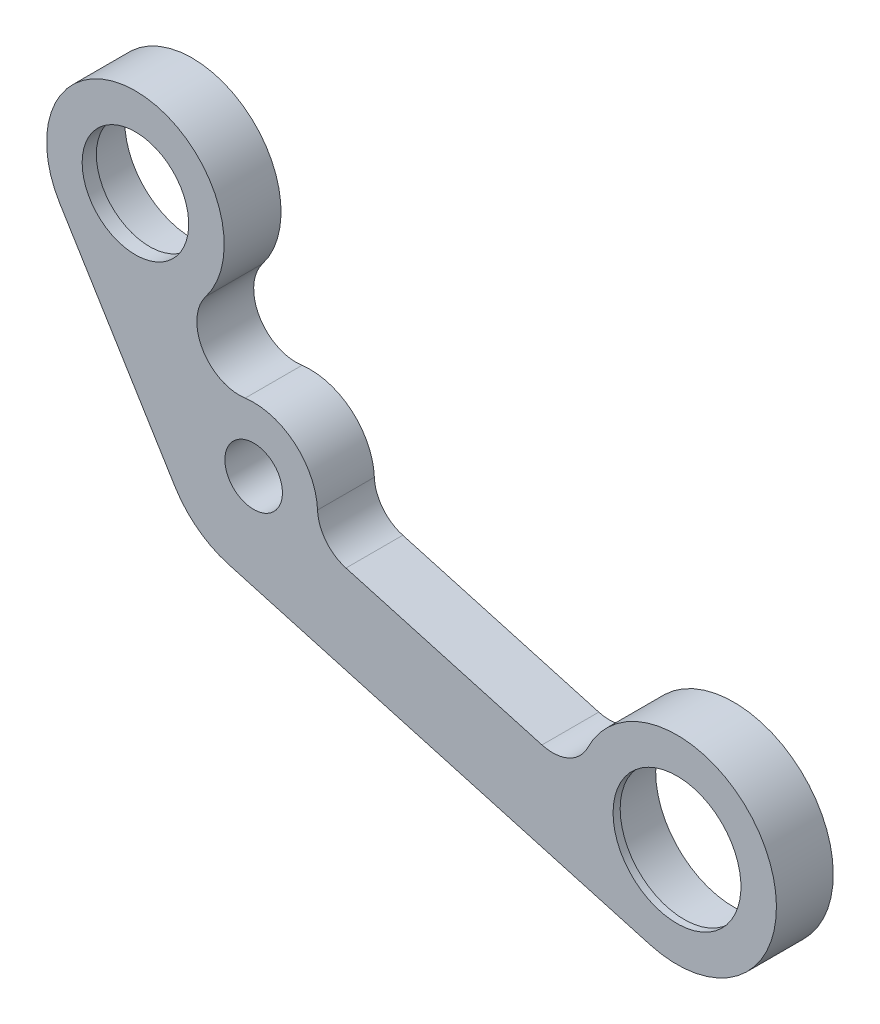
ISO-10303-21;
HEADER;
FILE_DESCRIPTION(('STEP AP214'),'2;1');
FILE_NAME('part.step','',(''),(''),'','','');
FILE_SCHEMA(('AUTOMOTIVE_DESIGN { 1 0 10303 214 1 1 1 1 }'));
ENDSEC;
DATA;
#1=APPLICATION_CONTEXT('core data for automotive mechanical design processes');
#2=APPLICATION_PROTOCOL_DEFINITION('international standard','automotive_design',2000,#1);
#3=PRODUCT_CONTEXT('',#1,'mechanical');
#4=PRODUCT('Part','Part','',(#3));
#5=PRODUCT_RELATED_PRODUCT_CATEGORY('part','',(#4));
#6=PRODUCT_DEFINITION_FORMATION('','',#4);
#7=PRODUCT_DEFINITION_CONTEXT('part definition',#1,'design');
#8=PRODUCT_DEFINITION('design','',#6,#7);
#9=PRODUCT_DEFINITION_SHAPE('','',#8);
#10=(LENGTH_UNIT() NAMED_UNIT(*) SI_UNIT(.MILLI.,.METRE.));
#11=(NAMED_UNIT(*) PLANE_ANGLE_UNIT() SI_UNIT($,.RADIAN.));
#12=(NAMED_UNIT(*) SI_UNIT($,.STERADIAN.) SOLID_ANGLE_UNIT());
#13=UNCERTAINTY_MEASURE_WITH_UNIT(LENGTH_MEASURE(1.E-05),#10,'distance_accuracy_value','');
#14=(GEOMETRIC_REPRESENTATION_CONTEXT(3) GLOBAL_UNCERTAINTY_ASSIGNED_CONTEXT((#13)) GLOBAL_UNIT_ASSIGNED_CONTEXT((#10,
#11,#12)) REPRESENTATION_CONTEXT('',''));
#15=CARTESIAN_POINT('',(0.,0.,0.));
#16=DIRECTION('',(0.,0.,1.));
#17=DIRECTION('',(1.,0.,0.));
#18=AXIS2_PLACEMENT_3D('',#15,#16,#17);
#19=CARTESIAN_POINT('',(-59.10260396,256.225433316,25.));
#20=DIRECTION('',(0.,0.,-1.));
#21=DIRECTION('',(-1.,0.,0.));
#22=AXIS2_PLACEMENT_3D('',#19,#20,#21);
#23=CYLINDRICAL_SURFACE('',#22,7.499999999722);
#24=CARTESIAN_POINT('',(-59.10260396,256.225433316,23.));
#25=DIRECTION('',(0.,0.,-1.));
#26=DIRECTION('',(-1.,0.,0.));
#27=AXIS2_PLACEMENT_3D('',#24,#25,#26);
#28=CIRCLE('',#27,7.499999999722);
#29=CARTESIAN_POINT('',(-66.602603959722,256.225433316,23.));
#30=VERTEX_POINT('',#29);
#31=EDGE_CURVE('E217',#30,#30,#28,.F.);
#32=ORIENTED_EDGE('',*,*,#31,.F.);
#33=EDGE_LOOP('',(#32));
#34=FACE_BOUND('',#33,.T.);
#35=CARTESIAN_POINT('',(-59.10260396,256.225433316,25.));
#36=DIRECTION('',(0.,0.,-1.));
#37=DIRECTION('',(-1.,0.,0.));
#38=AXIS2_PLACEMENT_3D('',#35,#36,#37);
#39=CIRCLE('',#38,7.499999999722);
#40=CARTESIAN_POINT('',(-66.602603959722,256.225433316,25.));
#41=VERTEX_POINT('',#40);
#42=EDGE_CURVE('E21',#41,#41,#39,.T.);
#43=ORIENTED_EDGE('',*,*,#42,.F.);
#44=EDGE_LOOP('',(#43));
#45=FACE_BOUND('',#44,.T.);
#46=ADVANCED_FACE('F17',(#34,#45),#23,.F.);
#47=CARTESIAN_POINT('',(16.439924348,182.567015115,25.));
#48=DIRECTION('',(0.,0.,1.));
#49=DIRECTION('',(0.481671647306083,0.876351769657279,0.));
#50=AXIS2_PLACEMENT_3D('',#47,#48,#49);
#51=PLANE('',#50);
#52=ORIENTED_EDGE('',*,*,#42,.T.);
#53=EDGE_LOOP('',(#52));
#54=FACE_BOUND('',#53,.T.);
#55=CARTESIAN_POINT('',(-42.457488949,230.060145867,25.));
#56=DIRECTION('',(0.,0.,-1.));
#57=DIRECTION('',(-1.,0.,0.));
#58=AXIS2_PLACEMENT_3D('',#55,#56,#57);
#59=CIRCLE('',#58,4.0500000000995);
#60=CARTESIAN_POINT('',(-46.5074889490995,230.060145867,25.));
#61=VERTEX_POINT('',#60);
#62=EDGE_CURVE('E102',#61,#61,#59,.F.);
#63=ORIENTED_EDGE('',*,*,#62,.F.);
#64=EDGE_LOOP('',(#63));
#65=FACE_BOUND('',#64,.T.);
#66=CARTESIAN_POINT('',(17.14,214.32,25.));
#67=DIRECTION('',(0.,0.,-1.));
#68=DIRECTION('',(-1.,0.,0.));
#69=AXIS2_PLACEMENT_3D('',#66,#67,#68);
#70=CIRCLE('',#69,9.00000000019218);
#71=CARTESIAN_POINT('',(8.13999999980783,214.32,25.));
#72=VERTEX_POINT('',#71);
#73=EDGE_CURVE('E113',#72,#72,#70,.F.);
#74=ORIENTED_EDGE('',*,*,#73,.F.);
#75=EDGE_LOOP('',(#74));
#76=FACE_BOUND('',#75,.T.);
#77=CARTESIAN_POINT('',(-42.457488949,230.060145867,25.));
#78=DIRECTION('',(0.,0.,1.));
#79=DIRECTION('',(1.,0.,0.));
#80=AXIS2_PLACEMENT_3D('',#77,#78,#79);
#81=CIRCLE('',#80,13.0000000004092);
#82=CARTESIAN_POINT('',(-53.5372151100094,223.260170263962,25.));
#83=VERTEX_POINT('',#82);
#84=CARTESIAN_POINT('',(-45.9805335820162,217.546626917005,25.));
#85=VERTEX_POINT('',#84);
#86=EDGE_CURVE('E196',#83,#85,#81,.T.);
#87=ORIENTED_EDGE('',*,*,#86,.T.);
#88=DIRECTION('',(0.962578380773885,-0.271003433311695,0.));
#89=VECTOR('',#88,1.);
#90=CARTESIAN_POINT('',(-16.317290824,209.195264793,25.));
#91=LINE('',#90,#89);
#92=CARTESIAN_POINT('',(13.3459519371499,200.843902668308,25.));
#93=VERTEX_POINT('',#92);
#94=EDGE_CURVE('E99',#85,#93,#91,.T.);
#95=ORIENTED_EDGE('',*,*,#94,.T.);
#96=CARTESIAN_POINT('',(17.14,214.32,25.));
#97=DIRECTION('',(0.,0.,1.));
#98=DIRECTION('',(1.,0.,0.));
#99=AXIS2_PLACEMENT_3D('',#96,#97,#98);
#100=CIRCLE('',#99,13.9999999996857);
#101=CARTESIAN_POINT('',(4.56373326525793,220.471220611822,25.));
#102=VERTEX_POINT('',#101);
#103=EDGE_CURVE('E96',#93,#102,#100,.T.);
#104=ORIENTED_EDGE('',*,*,#103,.T.);
#105=CARTESIAN_POINT('',(-0.376942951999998,222.887771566,25.));
#106=DIRECTION('',(0.,0.,1.));
#107=DIRECTION('',(1.,0.,0.));
#108=AXIS2_PLACEMENT_3D('',#105,#106,#107);
#109=CIRCLE('',#108,5.49999999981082);
#110=CARTESIAN_POINT('',(-1.86746183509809,217.593590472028,25.));
#111=VERTEX_POINT('',#110);
#112=EDGE_CURVE('E94',#111,#102,#109,.T.);
#113=ORIENTED_EDGE('',*,*,#112,.F.);
#114=DIRECTION('',(-0.962578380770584,0.271003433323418,0.));
#115=VECTOR('',#114,1.);
#116=CARTESIAN_POINT('',(-15.6638634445,221.477816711,25.));
#117=LINE('',#116,#115);
#118=CARTESIAN_POINT('',(-29.4602650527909,225.3620429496,25.));
#119=VERTEX_POINT('',#118);
#120=EDGE_CURVE('E123',#111,#119,#117,.T.);
#121=ORIENTED_EDGE('',*,*,#120,.T.);
#122=CARTESIAN_POINT('',(-27.969746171,230.656224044,25.));
#123=DIRECTION('',(0.,0.,1.));
#124=DIRECTION('',(1.,0.,0.));
#125=AXIS2_PLACEMENT_3D('',#122,#123,#124);
#126=CIRCLE('',#125,5.49999999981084);
#127=CARTESIAN_POINT('',(-33.4650968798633,230.430125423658,25.));
#128=VERTEX_POINT('',#127);
#129=EDGE_CURVE('E136',#128,#119,#126,.T.);
#130=ORIENTED_EDGE('',*,*,#129,.F.);
#131=CARTESIAN_POINT('',(-42.457488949,230.060145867,25.));
#132=DIRECTION('',(0.,0.,1.));
#133=DIRECTION('',(1.,0.,0.));
#134=AXIS2_PLACEMENT_3D('',#131,#132,#133);
#135=CIRCLE('',#134,8.99999999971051);
#136=CARTESIAN_POINT('',(-43.6552435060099,238.980088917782,25.));
#137=VERTEX_POINT('',#136);
#138=EDGE_CURVE('E207',#128,#137,#135,.T.);
#139=ORIENTED_EDGE('',*,*,#138,.T.);
#140=CARTESIAN_POINT('',(-44.453746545,244.926717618,25.));
#141=DIRECTION('',(0.,0.,1.));
#142=DIRECTION('',(1.,0.,0.));
#143=AXIS2_PLACEMENT_3D('',#140,#141,#142);
#144=CIRCLE('',#143,6.00000000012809);
#145=CARTESIAN_POINT('',(-49.2047273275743,248.5911659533,25.));
#146=VERTEX_POINT('',#145);
#147=EDGE_CURVE('E203',#146,#137,#144,.T.);
#148=ORIENTED_EDGE('',*,*,#147,.F.);
#149=CARTESIAN_POINT('',(-59.10260396,256.225433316,25.));
#150=DIRECTION('',(0.,0.,1.));
#151=DIRECTION('',(1.,0.,0.));
#152=AXIS2_PLACEMENT_3D('',#149,#150,#151);
#153=CIRCLE('',#152,12.5000000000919);
#154=CARTESIAN_POINT('',(-69.7561868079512,249.68699523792,25.));
#155=VERTEX_POINT('',#154);
#156=EDGE_CURVE('E199',#146,#155,#153,.T.);
#157=ORIENTED_EDGE('',*,*,#156,.T.);
#158=DIRECTION('',(0.52307504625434,-0.852286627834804,0.));
#159=VECTOR('',#158,1.);
#160=CARTESIAN_POINT('',(-61.6467009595,236.473582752,25.));
#161=LINE('',#160,#159);
#162=EDGE_CURVE('E130',#155,#83,#161,.T.);
#163=ORIENTED_EDGE('',*,*,#162,.T.);
#164=EDGE_LOOP('',(#87,#95,#104,#113,#121,#130,#139,#148,#157,#163));
#165=FACE_BOUND('',#164,.T.);
#166=ADVANCED_FACE('F97',(#54,#65,#76,#165),#51,.T.);
#167=CARTESIAN_POINT('',(-46.046566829,260.019888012,23.));
#168=DIRECTION('',(0.,0.,-1.));
#169=DIRECTION('',(-0.481671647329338,-0.876351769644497,0.));
#170=AXIS2_PLACEMENT_3D('',#167,#168,#169);
#171=PLANE('',#170);
#172=ORIENTED_EDGE('',*,*,#31,.T.);
#173=EDGE_LOOP('',(#172));
#174=FACE_BOUND('',#173,.T.);
#175=CARTESIAN_POINT('',(-59.10260396,256.225433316,23.));
#176=DIRECTION('',(0.,0.,-1.));
#177=DIRECTION('',(-1.,0.,0.));
#178=AXIS2_PLACEMENT_3D('',#175,#176,#177);
#179=CIRCLE('',#178,9.5000000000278);
#180=CARTESIAN_POINT('',(-68.6026039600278,256.225433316,23.));
#181=VERTEX_POINT('',#180);
#182=EDGE_CURVE('E189',#181,#181,#179,.F.);
#183=ORIENTED_EDGE('',*,*,#182,.F.);
#184=EDGE_LOOP('',(#183));
#185=FACE_BOUND('',#184,.T.);
#186=ADVANCED_FACE('F237',(#174,#185),#171,.T.);
#187=CARTESIAN_POINT('',(17.14,214.32,25.));
#188=DIRECTION('',(0.,0.,-1.));
#189=DIRECTION('',(-1.,0.,0.));
#190=AXIS2_PLACEMENT_3D('',#187,#188,#189);
#191=CYLINDRICAL_SURFACE('',#190,9.00000000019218);
#192=ORIENTED_EDGE('',*,*,#73,.T.);
#193=EDGE_LOOP('',(#192));
#194=FACE_BOUND('',#193,.T.);
#195=CARTESIAN_POINT('',(17.14,214.32,24.));
#196=DIRECTION('',(0.,0.,-1.));
#197=DIRECTION('',(-1.,0.,0.));
#198=AXIS2_PLACEMENT_3D('',#195,#196,#197);
#199=CIRCLE('',#198,9.00000000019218);
#200=CARTESIAN_POINT('',(8.13999999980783,214.32,24.));
#201=VERTEX_POINT('',#200);
#202=EDGE_CURVE('E185',#201,#201,#199,.F.);
#203=ORIENTED_EDGE('',*,*,#202,.F.);
#204=EDGE_LOOP('',(#203));
#205=FACE_BOUND('',#204,.T.);
#206=ADVANCED_FACE('F256',(#194,#205),#191,.F.);
#207=CARTESIAN_POINT('',(-0.376942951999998,222.887771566,17.));
#208=DIRECTION('',(0.,0.,1.));
#209=DIRECTION('',(1.,0.,0.));
#210=AXIS2_PLACEMENT_3D('',#207,#208,#209);
#211=CYLINDRICAL_SURFACE('',#210,5.49999999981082);
#212=CARTESIAN_POINT('',(-0.376942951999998,222.887771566,17.));
#213=DIRECTION('',(0.,0.,1.));
#214=DIRECTION('',(1.,0.,0.));
#215=AXIS2_PLACEMENT_3D('',#212,#213,#214);
#216=CIRCLE('',#215,5.49999999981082);
#217=CARTESIAN_POINT('',(4.56373326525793,220.471220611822,17.));
#218=VERTEX_POINT('',#217);
#219=CARTESIAN_POINT('',(-1.86746183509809,217.593590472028,17.));
#220=VERTEX_POINT('',#219);
#221=EDGE_CURVE('E182',#218,#220,#216,.F.);
#222=ORIENTED_EDGE('',*,*,#221,.T.);
#223=DIRECTION('',(0.,0.,1.));
#224=VECTOR('',#223,1.);
#225=CARTESIAN_POINT('',(-1.86746183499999,217.593590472,21.));
#226=LINE('',#225,#224);
#227=EDGE_CURVE('E111',#220,#111,#226,.T.);
#228=ORIENTED_EDGE('',*,*,#227,.T.);
#229=ORIENTED_EDGE('',*,*,#112,.T.);
#230=DIRECTION('',(0.,0.,1.));
#231=VECTOR('',#230,1.);
#232=CARTESIAN_POINT('',(4.56373326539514,220.471220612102,21.));
#233=LINE('',#232,#231);
#234=EDGE_CURVE('E109',#102,#218,#233,.F.);
#235=ORIENTED_EDGE('',*,*,#234,.T.);
#236=EDGE_LOOP('',(#222,#228,#229,#235));
#237=FACE_BOUND('',#236,.T.);
#238=ADVANCED_FACE('F108',(#237),#211,.F.);
#239=CARTESIAN_POINT('',(-1.86746183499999,217.593590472,25.));
#240=DIRECTION('',(-0.271003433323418,-0.962578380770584,0.));
#241=DIRECTION('',(-0.962578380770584,0.271003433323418,0.));
#242=AXIS2_PLACEMENT_3D('',#239,#240,#241);
#243=PLANE('',#242);
#244=ORIENTED_EDGE('',*,*,#227,.F.);
#245=DIRECTION('',(-0.962578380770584,0.271003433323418,0.));
#246=VECTOR('',#245,1.);
#247=CARTESIAN_POINT('',(-1.86746183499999,217.593590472,17.));
#248=LINE('',#247,#246);
#249=CARTESIAN_POINT('',(-29.4602650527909,225.3620429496,17.));
#250=VERTEX_POINT('',#249);
#251=EDGE_CURVE('E178',#220,#250,#248,.T.);
#252=ORIENTED_EDGE('',*,*,#251,.T.);
#253=DIRECTION('',(0.,0.,1.));
#254=VECTOR('',#253,1.);
#255=CARTESIAN_POINT('',(-29.4602650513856,225.362042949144,21.));
#256=LINE('',#255,#254);
#257=EDGE_CURVE('E213',#119,#250,#256,.F.);
#258=ORIENTED_EDGE('',*,*,#257,.F.);
#259=ORIENTED_EDGE('',*,*,#120,.F.);
#260=EDGE_LOOP('',(#244,#252,#258,#259));
#261=FACE_BOUND('',#260,.T.);
#262=ADVANCED_FACE('F257',(#261),#243,.F.);
#263=CARTESIAN_POINT('',(-27.969746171,230.656224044,17.));
#264=DIRECTION('',(0.,0.,1.));
#265=DIRECTION('',(1.,0.,0.));
#266=AXIS2_PLACEMENT_3D('',#263,#264,#265);
#267=CYLINDRICAL_SURFACE('',#266,5.49999999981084);
#268=CARTESIAN_POINT('',(-27.969746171,230.656224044,17.));
#269=DIRECTION('',(0.,0.,1.));
#270=DIRECTION('',(1.,0.,0.));
#271=AXIS2_PLACEMENT_3D('',#268,#269,#270);
#272=CIRCLE('',#271,5.49999999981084);
#273=CARTESIAN_POINT('',(-33.4650968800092,230.430125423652,17.));
#274=VERTEX_POINT('',#273);
#275=EDGE_CURVE('E174',#250,#274,#272,.F.);
#276=ORIENTED_EDGE('',*,*,#275,.T.);
#277=DIRECTION('',(0.,0.,-1.));
#278=VECTOR('',#277,1.);
#279=CARTESIAN_POINT('',(-33.4650968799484,230.430125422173,21.));
#280=LINE('',#279,#278);
#281=EDGE_CURVE('E211',#274,#128,#280,.F.);
#282=ORIENTED_EDGE('',*,*,#281,.T.);
#283=ORIENTED_EDGE('',*,*,#129,.T.);
#284=ORIENTED_EDGE('',*,*,#257,.T.);
#285=EDGE_LOOP('',(#276,#282,#283,#284));
#286=FACE_BOUND('',#285,.T.);
#287=ADVANCED_FACE('F260',(#286),#267,.F.);
#288=CARTESIAN_POINT('',(-42.457488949,230.060145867,17.));
#289=DIRECTION('',(0.,0.,1.));
#290=DIRECTION('',(1.,0.,0.));
#291=AXIS2_PLACEMENT_3D('',#288,#289,#290);
#292=CYLINDRICAL_SURFACE('',#291,8.99999999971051);
#293=CARTESIAN_POINT('',(-42.457488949,230.060145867,17.));
#294=DIRECTION('',(0.,0.,1.));
#295=DIRECTION('',(1.,0.,0.));
#296=AXIS2_PLACEMENT_3D('',#293,#294,#295);
#297=CIRCLE('',#296,8.99999999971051);
#298=CARTESIAN_POINT('',(-43.6552435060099,238.980088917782,17.));
#299=VERTEX_POINT('',#298);
#300=EDGE_CURVE('E170',#274,#299,#297,.T.);
#301=ORIENTED_EDGE('',*,*,#300,.T.);
#302=DIRECTION('',(0.,0.,1.));
#303=VECTOR('',#302,1.);
#304=CARTESIAN_POINT('',(-43.6552435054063,238.980088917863,21.));
#305=LINE('',#304,#303);
#306=EDGE_CURVE('E206',#137,#299,#305,.F.);
#307=ORIENTED_EDGE('',*,*,#306,.F.);
#308=ORIENTED_EDGE('',*,*,#138,.F.);
#309=ORIENTED_EDGE('',*,*,#281,.F.);
#310=EDGE_LOOP('',(#301,#307,#308,#309));
#311=FACE_BOUND('',#310,.T.);
#312=ADVANCED_FACE('F291',(#311),#292,.T.);
#313=CARTESIAN_POINT('',(-44.453746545,244.926717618,17.));
#314=DIRECTION('',(0.,0.,1.));
#315=DIRECTION('',(1.,0.,0.));
#316=AXIS2_PLACEMENT_3D('',#313,#314,#315);
#317=CYLINDRICAL_SURFACE('',#316,6.00000000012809);
#318=CARTESIAN_POINT('',(-44.453746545,244.926717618,17.));
#319=DIRECTION('',(0.,0.,1.));
#320=DIRECTION('',(1.,0.,0.));
#321=AXIS2_PLACEMENT_3D('',#318,#319,#320);
#322=CIRCLE('',#321,6.00000000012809);
#323=CARTESIAN_POINT('',(-49.204727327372,248.591165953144,17.));
#324=VERTEX_POINT('',#323);
#325=EDGE_CURVE('E166',#299,#324,#322,.F.);
#326=ORIENTED_EDGE('',*,*,#325,.T.);
#327=DIRECTION('',(0.,0.,-1.));
#328=VECTOR('',#327,1.);
#329=CARTESIAN_POINT('',(-49.2047273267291,248.591165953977,21.));
#330=LINE('',#329,#328);
#331=EDGE_CURVE('E202',#324,#146,#330,.F.);
#332=ORIENTED_EDGE('',*,*,#331,.T.);
#333=ORIENTED_EDGE('',*,*,#147,.T.);
#334=ORIENTED_EDGE('',*,*,#306,.T.);
#335=EDGE_LOOP('',(#326,#332,#333,#334));
#336=FACE_BOUND('',#335,.T.);
#337=ADVANCED_FACE('F295',(#336),#317,.F.);
#338=CARTESIAN_POINT('',(-59.10260396,256.225433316,17.));
#339=DIRECTION('',(0.,0.,1.));
#340=DIRECTION('',(1.,0.,0.));
#341=AXIS2_PLACEMENT_3D('',#338,#339,#340);
#342=CYLINDRICAL_SURFACE('',#341,12.5000000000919);
#343=CARTESIAN_POINT('',(-59.10260396,256.225433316,17.));
#344=DIRECTION('',(0.,0.,1.));
#345=DIRECTION('',(1.,0.,0.));
#346=AXIS2_PLACEMENT_3D('',#343,#344,#345);
#347=CIRCLE('',#346,12.5000000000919);
#348=CARTESIAN_POINT('',(-69.7561868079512,249.68699523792,17.));
#349=VERTEX_POINT('',#348);
#350=EDGE_CURVE('E162',#324,#349,#347,.T.);
#351=ORIENTED_EDGE('',*,*,#350,.T.);
#352=DIRECTION('',(0.,0.,1.));
#353=VECTOR('',#352,1.);
#354=CARTESIAN_POINT('',(-69.756186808,249.686995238,21.));
#355=LINE('',#354,#353);
#356=EDGE_CURVE('E134',#349,#155,#355,.T.);
#357=ORIENTED_EDGE('',*,*,#356,.T.);
#358=ORIENTED_EDGE('',*,*,#156,.F.);
#359=ORIENTED_EDGE('',*,*,#331,.F.);
#360=EDGE_LOOP('',(#351,#357,#358,#359));
#361=FACE_BOUND('',#360,.T.);
#362=ADVANCED_FACE('F266',(#361),#342,.T.);
#363=CARTESIAN_POINT('',(-69.756186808,249.686995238,25.));
#364=DIRECTION('',(0.852286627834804,0.52307504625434,0.));
#365=DIRECTION('',(0.52307504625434,-0.852286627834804,0.));
#366=AXIS2_PLACEMENT_3D('',#363,#364,#365);
#367=PLANE('',#366);
#368=ORIENTED_EDGE('',*,*,#356,.F.);
#369=DIRECTION('',(0.52307504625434,-0.852286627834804,0.));
#370=VECTOR('',#369,1.);
#371=CARTESIAN_POINT('',(-69.756186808,249.686995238,17.));
#372=LINE('',#371,#370);
#373=CARTESIAN_POINT('',(-53.5372151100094,223.260170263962,17.));
#374=VERTEX_POINT('',#373);
#375=EDGE_CURVE('E158',#349,#374,#372,.T.);
#376=ORIENTED_EDGE('',*,*,#375,.T.);
#377=DIRECTION('',(0.,0.,-1.));
#378=VECTOR('',#377,1.);
#379=CARTESIAN_POINT('',(-53.5372151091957,223.260170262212,21.));
#380=LINE('',#379,#378);
#381=EDGE_CURVE('E133',#374,#83,#380,.F.);
#382=ORIENTED_EDGE('',*,*,#381,.T.);
#383=ORIENTED_EDGE('',*,*,#162,.F.);
#384=EDGE_LOOP('',(#368,#376,#382,#383));
#385=FACE_BOUND('',#384,.T.);
#386=ADVANCED_FACE('F262',(#385),#367,.F.);
#387=CARTESIAN_POINT('',(-42.457488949,230.060145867,17.));
#388=DIRECTION('',(0.,0.,1.));
#389=DIRECTION('',(1.,0.,0.));
#390=AXIS2_PLACEMENT_3D('',#387,#388,#389);
#391=CYLINDRICAL_SURFACE('',#390,13.0000000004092);
#392=ORIENTED_EDGE('',*,*,#381,.F.);
#393=CARTESIAN_POINT('',(-42.457488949,230.060145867,17.));
#394=DIRECTION('',(0.,0.,1.));
#395=DIRECTION('',(1.,0.,0.));
#396=AXIS2_PLACEMENT_3D('',#393,#394,#395);
#397=CIRCLE('',#396,13.0000000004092);
#398=CARTESIAN_POINT('',(-45.9805335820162,217.546626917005,17.));
#399=VERTEX_POINT('',#398);
#400=EDGE_CURVE('E155',#374,#399,#397,.T.);
#401=ORIENTED_EDGE('',*,*,#400,.T.);
#402=DIRECTION('',(0.,0.,1.));
#403=VECTOR('',#402,1.);
#404=CARTESIAN_POINT('',(-45.980533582,217.546626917,21.));
#405=LINE('',#404,#403);
#406=EDGE_CURVE('E129',#399,#85,#405,.T.);
#407=ORIENTED_EDGE('',*,*,#406,.T.);
#408=ORIENTED_EDGE('',*,*,#86,.F.);
#409=EDGE_LOOP('',(#392,#401,#407,#408));
#410=FACE_BOUND('',#409,.T.);
#411=ADVANCED_FACE('F265',(#410),#391,.T.);
#412=CARTESIAN_POINT('',(-45.980533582,217.546626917,25.));
#413=DIRECTION('',(0.271003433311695,0.962578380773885,0.));
#414=DIRECTION('',(0.962578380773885,-0.271003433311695,0.));
#415=AXIS2_PLACEMENT_3D('',#412,#413,#414);
#416=PLANE('',#415);
#417=ORIENTED_EDGE('',*,*,#406,.F.);
#418=DIRECTION('',(0.962578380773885,-0.271003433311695,0.));
#419=VECTOR('',#418,1.);
#420=CARTESIAN_POINT('',(-45.980533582,217.546626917,17.));
#421=LINE('',#420,#419);
#422=CARTESIAN_POINT('',(13.3459519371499,200.843902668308,17.));
#423=VERTEX_POINT('',#422);
#424=EDGE_CURVE('E151',#399,#423,#421,.T.);
#425=ORIENTED_EDGE('',*,*,#424,.T.);
#426=DIRECTION('',(0.,0.,-1.));
#427=VECTOR('',#426,1.);
#428=CARTESIAN_POINT('',(13.3459519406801,200.843902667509,21.));
#429=LINE('',#428,#427);
#430=EDGE_CURVE('E37',#423,#93,#429,.F.);
#431=ORIENTED_EDGE('',*,*,#430,.T.);
#432=ORIENTED_EDGE('',*,*,#94,.F.);
#433=EDGE_LOOP('',(#417,#425,#431,#432));
#434=FACE_BOUND('',#433,.T.);
#435=ADVANCED_FACE('F268',(#434),#416,.F.);
#436=CARTESIAN_POINT('',(17.14,214.32,17.));
#437=DIRECTION('',(0.,0.,1.));
#438=DIRECTION('',(1.,0.,0.));
#439=AXIS2_PLACEMENT_3D('',#436,#437,#438);
#440=CYLINDRICAL_SURFACE('',#439,13.9999999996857);
#441=CARTESIAN_POINT('',(17.14,214.32,17.));
#442=DIRECTION('',(0.,0.,1.));
#443=DIRECTION('',(1.,0.,0.));
#444=AXIS2_PLACEMENT_3D('',#441,#442,#443);
#445=CIRCLE('',#444,13.9999999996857);
#446=EDGE_CURVE('E116',#423,#218,#445,.T.);
#447=ORIENTED_EDGE('',*,*,#446,.T.);
#448=ORIENTED_EDGE('',*,*,#234,.F.);
#449=ORIENTED_EDGE('',*,*,#103,.F.);
#450=ORIENTED_EDGE('',*,*,#430,.F.);
#451=EDGE_LOOP('',(#447,#448,#449,#450));
#452=FACE_BOUND('',#451,.T.);
#453=ADVANCED_FACE('F115',(#452),#440,.T.);
#454=CARTESIAN_POINT('',(-42.457488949,230.060145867,25.));
#455=DIRECTION('',(0.,0.,-1.));
#456=DIRECTION('',(-1.,0.,0.));
#457=AXIS2_PLACEMENT_3D('',#454,#455,#456);
#458=CYLINDRICAL_SURFACE('',#457,4.0500000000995);
#459=ORIENTED_EDGE('',*,*,#62,.T.);
#460=EDGE_LOOP('',(#459));
#461=FACE_BOUND('',#460,.T.);
#462=CARTESIAN_POINT('',(-42.457488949,230.060145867,17.));
#463=DIRECTION('',(0.,0.,-1.));
#464=DIRECTION('',(-1.,0.,0.));
#465=AXIS2_PLACEMENT_3D('',#462,#463,#464);
#466=CIRCLE('',#465,4.0500000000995);
#467=CARTESIAN_POINT('',(-46.5074889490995,230.060145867,17.));
#468=VERTEX_POINT('',#467);
#469=EDGE_CURVE('E145',#468,#468,#466,.T.);
#470=ORIENTED_EDGE('',*,*,#469,.T.);
#471=EDGE_LOOP('',(#470));
#472=FACE_BOUND('',#471,.T.);
#473=ADVANCED_FACE('F276',(#461,#472),#458,.F.);
#474=CARTESIAN_POINT('',(-59.10260396,256.225433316,23.));
#475=DIRECTION('',(0.,0.,-1.));
#476=DIRECTION('',(-1.,0.,0.));
#477=AXIS2_PLACEMENT_3D('',#474,#475,#476);
#478=CYLINDRICAL_SURFACE('',#477,9.5000000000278);
#479=ORIENTED_EDGE('',*,*,#182,.T.);
#480=EDGE_LOOP('',(#479));
#481=FACE_BOUND('',#480,.T.);
#482=CARTESIAN_POINT('',(-59.10260396,256.225433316,17.));
#483=DIRECTION('',(0.,0.,-1.));
#484=DIRECTION('',(-1.,0.,0.));
#485=AXIS2_PLACEMENT_3D('',#482,#483,#484);
#486=CIRCLE('',#485,9.5000000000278);
#487=CARTESIAN_POINT('',(-68.6026039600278,256.225433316,17.));
#488=VERTEX_POINT('',#487);
#489=EDGE_CURVE('E141',#488,#488,#486,.T.);
#490=ORIENTED_EDGE('',*,*,#489,.T.);
#491=EDGE_LOOP('',(#490));
#492=FACE_BOUND('',#491,.T.);
#493=ADVANCED_FACE('F251',(#481,#492),#478,.F.);
#494=CARTESIAN_POINT('',(32.257516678,218.713579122,24.));
#495=DIRECTION('',(0.,0.,-1.));
#496=DIRECTION('',(-0.481671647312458,-0.876351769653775,0.));
#497=AXIS2_PLACEMENT_3D('',#494,#495,#496);
#498=PLANE('',#497);
#499=ORIENTED_EDGE('',*,*,#202,.T.);
#500=EDGE_LOOP('',(#499));
#501=FACE_BOUND('',#500,.T.);
#502=CARTESIAN_POINT('',(17.14,214.32,24.));
#503=DIRECTION('',(0.,0.,-1.));
#504=DIRECTION('',(-1.,0.,0.));
#505=AXIS2_PLACEMENT_3D('',#502,#503,#504);
#506=CIRCLE('',#505,10.9999999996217);
#507=CARTESIAN_POINT('',(6.14000000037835,214.32,24.));
#508=VERTEX_POINT('',#507);
#509=EDGE_CURVE('E28',#508,#508,#506,.F.);
#510=ORIENTED_EDGE('',*,*,#509,.F.);
#511=EDGE_LOOP('',(#510));
#512=FACE_BOUND('',#511,.T.);
#513=ADVANCED_FACE('F247',(#501,#512),#498,.T.);
#514=CARTESIAN_POINT('',(16.439924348,182.567015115,17.));
#515=DIRECTION('',(0.,0.,1.));
#516=DIRECTION('',(0.481671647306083,0.876351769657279,0.));
#517=AXIS2_PLACEMENT_3D('',#514,#515,#516);
#518=PLANE('',#517);
#519=ORIENTED_EDGE('',*,*,#489,.F.);
#520=EDGE_LOOP('',(#519));
#521=FACE_BOUND('',#520,.T.);
#522=ORIENTED_EDGE('',*,*,#469,.F.);
#523=EDGE_LOOP('',(#522));
#524=FACE_BOUND('',#523,.T.);
#525=CARTESIAN_POINT('',(17.14,214.32,17.));
#526=DIRECTION('',(0.,0.,-1.));
#527=DIRECTION('',(-1.,0.,0.));
#528=AXIS2_PLACEMENT_3D('',#525,#526,#527);
#529=CIRCLE('',#528,10.9999999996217);
#530=CARTESIAN_POINT('',(6.14000000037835,214.32,17.));
#531=VERTEX_POINT('',#530);
#532=EDGE_CURVE('E11',#531,#531,#529,.T.);
#533=ORIENTED_EDGE('',*,*,#532,.F.);
#534=EDGE_LOOP('',(#533));
#535=FACE_BOUND('',#534,.T.);
#536=ORIENTED_EDGE('',*,*,#424,.F.);
#537=ORIENTED_EDGE('',*,*,#400,.F.);
#538=ORIENTED_EDGE('',*,*,#375,.F.);
#539=ORIENTED_EDGE('',*,*,#350,.F.);
#540=ORIENTED_EDGE('',*,*,#325,.F.);
#541=ORIENTED_EDGE('',*,*,#300,.F.);
#542=ORIENTED_EDGE('',*,*,#275,.F.);
#543=ORIENTED_EDGE('',*,*,#251,.F.);
#544=ORIENTED_EDGE('',*,*,#221,.F.);
#545=ORIENTED_EDGE('',*,*,#446,.F.);
#546=EDGE_LOOP('',(#536,#537,#538,#539,#540,#541,#542,#543,#544,#545));
#547=FACE_BOUND('',#546,.T.);
#548=ADVANCED_FACE('F19',(#521,#524,#535,#547),#518,.F.);
#549=CARTESIAN_POINT('',(17.14,214.32,24.));
#550=DIRECTION('',(0.,0.,-1.));
#551=DIRECTION('',(-1.,0.,0.));
#552=AXIS2_PLACEMENT_3D('',#549,#550,#551);
#553=CYLINDRICAL_SURFACE('',#552,10.9999999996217);
#554=ORIENTED_EDGE('',*,*,#532,.T.);
#555=EDGE_LOOP('',(#554));
#556=FACE_BOUND('',#555,.T.);
#557=ORIENTED_EDGE('',*,*,#509,.T.);
#558=EDGE_LOOP('',(#557));
#559=FACE_BOUND('',#558,.T.);
#560=ADVANCED_FACE('F240',(#556,#559),#553,.F.);
#561=CLOSED_SHELL('',(#46,#166,#186,#206,#238,#262,#287,#312,#337,#362,#386,#411,#435,#453,#473,
#493,#513,#548,#560));
#562=MANIFOLD_SOLID_BREP('B1',#561);
#563=ADVANCED_BREP_SHAPE_REPRESENTATION('',(#18,#562),#14);
#564=SHAPE_DEFINITION_REPRESENTATION(#9,#563);
ENDSEC;
END-ISO-10303-21;
